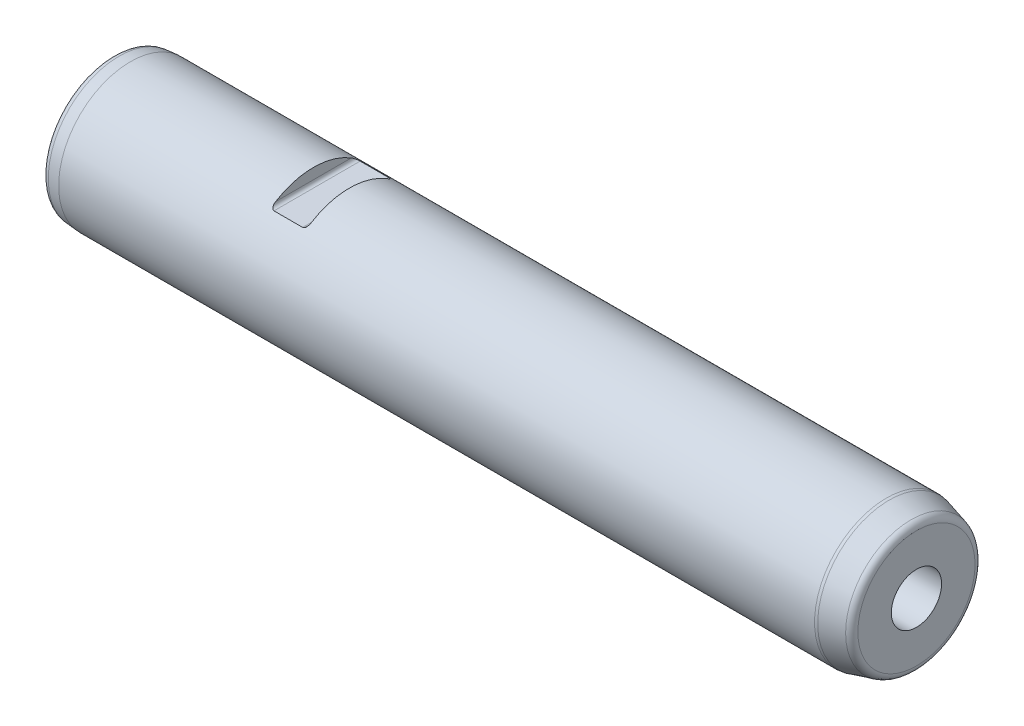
ISO-10303-21;
HEADER;
FILE_DESCRIPTION(('STEP AP214'),'2;1');
FILE_NAME('part.step','',(''),(''),'','','');
FILE_SCHEMA(('AUTOMOTIVE_DESIGN { 1 0 10303 214 1 1 1 1 }'));
ENDSEC;
DATA;
#1=APPLICATION_CONTEXT('core data for automotive mechanical design processes');
#2=APPLICATION_PROTOCOL_DEFINITION('international standard','automotive_design',2000,#1);
#3=PRODUCT_CONTEXT('',#1,'mechanical');
#4=PRODUCT('Part','Part','',(#3));
#5=PRODUCT_RELATED_PRODUCT_CATEGORY('part','',(#4));
#6=PRODUCT_DEFINITION_FORMATION('','',#4);
#7=PRODUCT_DEFINITION_CONTEXT('part definition',#1,'design');
#8=PRODUCT_DEFINITION('design','',#6,#7);
#9=PRODUCT_DEFINITION_SHAPE('','',#8);
#10=(LENGTH_UNIT() NAMED_UNIT(*) SI_UNIT(.MILLI.,.METRE.));
#11=(NAMED_UNIT(*) PLANE_ANGLE_UNIT() SI_UNIT($,.RADIAN.));
#12=(NAMED_UNIT(*) SI_UNIT($,.STERADIAN.) SOLID_ANGLE_UNIT());
#13=UNCERTAINTY_MEASURE_WITH_UNIT(LENGTH_MEASURE(1.E-05),#10,'distance_accuracy_value','');
#14=(GEOMETRIC_REPRESENTATION_CONTEXT(3) GLOBAL_UNCERTAINTY_ASSIGNED_CONTEXT((#13)) GLOBAL_UNIT_ASSIGNED_CONTEXT((#10,
#11,#12)) REPRESENTATION_CONTEXT('',''));
#15=CARTESIAN_POINT('',(0.,0.,0.));
#16=DIRECTION('',(0.,0.,1.));
#17=DIRECTION('',(1.,0.,0.));
#18=AXIS2_PLACEMENT_3D('',#15,#16,#17);
#19=CARTESIAN_POINT('',(0.,0.,0.));
#20=DIRECTION('',(1.,0.,0.));
#21=DIRECTION('',(0.,0.,-1.));
#22=AXIS2_PLACEMENT_3D('',#19,#20,#21);
#23=PLANE('',#22);
#24=CARTESIAN_POINT('',(0.,0.,0.));
#25=DIRECTION('',(1.,0.,0.));
#26=DIRECTION('',(0.,0.,-1.));
#27=AXIS2_PLACEMENT_3D('',#24,#25,#26);
#28=CIRCLE('',#27,17.7298943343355);
#29=CARTESIAN_POINT('',(0.,0.,-17.7298943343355));
#30=VERTEX_POINT('',#29);
#31=EDGE_CURVE('E160',#30,#30,#28,.F.);
#32=ORIENTED_EDGE('',*,*,#31,.T.);
#33=EDGE_LOOP('',(#32));
#34=FACE_BOUND('',#33,.T.);
#35=ADVANCED_FACE('F15',(#34),#23,.F.);
#36=CARTESIAN_POINT('',(0.,0.,0.));
#37=DIRECTION('',(-1.,0.,0.));
#38=DIRECTION('',(0.,0.,1.));
#39=AXIS2_PLACEMENT_3D('',#36,#37,#38);
#40=CYLINDRICAL_SURFACE('',#39,20.);
#41=CARTESIAN_POINT('',(65.,16.,-12.));
#42=CARTESIAN_POINT('',(65.0203975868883,15.9999962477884,-12.0000045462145));
#43=CARTESIAN_POINT('',(65.0407804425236,16.0006247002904,-11.9991670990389));
#44=CARTESIAN_POINT('',(65.0813146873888,16.0031055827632,-11.9958583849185));
#45=CARTESIAN_POINT('',(65.1014663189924,16.004956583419,-11.993389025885));
#46=CARTESIAN_POINT('',(65.1608545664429,16.0122253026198,-11.9836850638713));
#47=CARTESIAN_POINT('',(65.1995323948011,16.0193609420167,-11.9741518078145));
#48=CARTESIAN_POINT('',(65.2739645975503,16.037497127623,-11.9498497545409));
#49=CARTESIAN_POINT('',(65.3097307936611,16.0484809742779,-11.9351035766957));
#50=CARTESIAN_POINT('',(65.3781242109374,16.0735266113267,-11.9013522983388));
#51=CARTESIAN_POINT('',(65.41074138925,16.087597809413,-11.8823341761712));
#52=CARTESIAN_POINT('',(65.4887324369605,16.1259889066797,-11.8302152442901));
#53=CARTESIAN_POINT('',(65.5318948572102,16.1518280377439,-11.7949407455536));
#54=CARTESIAN_POINT('',(65.6109129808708,16.2068340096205,-11.7192462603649));
#55=CARTESIAN_POINT('',(65.6467545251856,16.2360071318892,-11.678816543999));
#56=CARTESIAN_POINT('',(65.7058021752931,16.2906763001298,-11.6023981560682));
#57=CARTESIAN_POINT('',(65.7301168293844,16.3158314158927,-11.567005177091));
#58=CARTESIAN_POINT('',(65.774915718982,16.3670212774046,-11.4944592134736));
#59=CARTESIAN_POINT('',(65.7953974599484,16.3930565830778,-11.4573051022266));
#60=CARTESIAN_POINT('',(65.8518244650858,16.4721604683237,-11.343563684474));
#61=CARTESIAN_POINT('',(65.8825725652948,16.526051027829,-11.2649424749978));
#62=CARTESIAN_POINT('',(65.9240070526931,16.615638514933,-11.1321438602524));
#63=CARTESIAN_POINT('',(65.9379569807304,16.6512330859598,-11.0788360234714));
#64=CARTESIAN_POINT('',(65.9614191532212,16.7223722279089,-10.9711632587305));
#65=CARTESIAN_POINT('',(65.9709289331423,16.7579167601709,-10.9167977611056));
#66=CARTESIAN_POINT('',(65.9857688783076,16.8281581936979,-10.808200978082));
#67=CARTESIAN_POINT('',(65.9911623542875,16.862859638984,-10.7539810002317));
#68=CARTESIAN_POINT('',(65.998268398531,16.9317984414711,-10.6451097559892));
#69=CARTESIAN_POINT('',(65.999986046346,16.9660363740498,-10.5904591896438));
#70=CARTESIAN_POINT('',(66.,17.,-10.5356537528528));
#71=B_SPLINE_CURVE_WITH_KNOTS('',3,(#41,#42,#43,#44,#45,#46,#47,#48,#49,#50,#51,#52,#53,#54,#55,
#56,#57,#58,#59,#60,#61,#62,#63,#64,#65,#66,#67,#68,#69,#70),.UNSPECIFIED.,.F.,.F.,(4,2,2,2,2,2,
2,2,2,2,2,2,2,2,4),(0.,0.0611385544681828,0.122205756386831,0.242843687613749,0.362964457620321,
0.483456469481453,0.66674777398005,0.850390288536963,0.999479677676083,1.14866576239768,
1.44807901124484,1.6447520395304,1.84153410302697,2.03522492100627,2.22864790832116),.UNSPECIFIED.);
#72=CARTESIAN_POINT('',(65.,16.,-12.));
#73=VERTEX_POINT('',#72);
#74=CARTESIAN_POINT('',(66.,17.,-10.5356537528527));
#75=VERTEX_POINT('',#74);
#76=EDGE_CURVE('E206',#73,#75,#71,.T.);
#77=ORIENTED_EDGE('',*,*,#76,.T.);
#78=CARTESIAN_POINT('',(66.,0.,0.));
#79=DIRECTION('',(1.,0.,0.));
#80=DIRECTION('',(0.,0.,-1.));
#81=AXIS2_PLACEMENT_3D('',#78,#79,#80);
#82=CIRCLE('',#81,20.);
#83=CARTESIAN_POINT('',(66.,17.,10.5356537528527));
#84=VERTEX_POINT('',#83);
#85=EDGE_CURVE('E9',#75,#84,#82,.T.);
#86=ORIENTED_EDGE('',*,*,#85,.T.);
#87=CARTESIAN_POINT('',(66.,17.,10.5356537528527));
#88=CARTESIAN_POINT('',(65.9999580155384,16.9556282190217,10.6072606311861));
#89=CARTESIAN_POINT('',(65.9970414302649,16.9107662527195,10.6786284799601));
#90=CARTESIAN_POINT('',(65.9847801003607,16.8201915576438,10.8207316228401));
#91=CARTESIAN_POINT('',(65.9754049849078,16.7744758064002,10.8914623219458));
#92=CARTESIAN_POINT('',(65.9494193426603,16.6823378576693,11.0320779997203));
#93=CARTESIAN_POINT('',(65.9327445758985,16.6359130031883,11.1019496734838));
#94=CARTESIAN_POINT('',(65.8911331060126,16.5434346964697,11.2392876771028));
#95=CARTESIAN_POINT('',(65.8662148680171,16.4973806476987,11.3067590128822));
#96=CARTESIAN_POINT('',(65.8154112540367,16.4198497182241,11.4189199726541));
#97=CARTESIAN_POINT('',(65.7919526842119,16.3880587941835,11.4644877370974));
#98=CARTESIAN_POINT('',(65.739534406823,16.3256491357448,11.5531862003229));
#99=CARTESIAN_POINT('',(65.7105793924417,16.2950294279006,11.596318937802));
#100=CARTESIAN_POINT('',(65.6461040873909,16.2354774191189,11.6795510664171));
#101=CARTESIAN_POINT('',(65.610528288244,16.2065623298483,11.7196204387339));
#102=CARTESIAN_POINT('',(65.5321445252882,16.1520057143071,11.7946959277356));
#103=CARTESIAN_POINT('',(65.489347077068,16.1263595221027,11.829709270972));
#104=CARTESIAN_POINT('',(65.4114116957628,16.0878834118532,11.8819483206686));
#105=CARTESIAN_POINT('',(65.3783803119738,16.0736117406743,11.9012377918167));
#106=CARTESIAN_POINT('',(65.3090792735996,16.048251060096,11.9354131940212));
#107=CARTESIAN_POINT('',(65.2728207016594,16.0371516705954,11.9503134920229));
#108=CARTESIAN_POINT('',(65.1981046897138,16.0190813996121,11.9745255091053));
#109=CARTESIAN_POINT('',(65.1596911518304,16.0120479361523,11.9839219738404));
#110=CARTESIAN_POINT('',(65.10072428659,16.0048841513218,11.9934856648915));
#111=CARTESIAN_POINT('',(65.0807179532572,16.0030600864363,11.9959190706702));
#112=CARTESIAN_POINT('',(65.040479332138,16.0006154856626,11.9991793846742));
#113=CARTESIAN_POINT('',(65.0202468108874,15.9999963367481,12.0000044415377));
#114=CARTESIAN_POINT('',(65.,16.,12.));
#115=B_SPLINE_CURVE_WITH_KNOTS('',3,(#87,#88,#89,#90,#91,#92,#93,#94,#95,#96,#97,#98,#99,#100,
#101,#102,#103,#104,#105,#106,#107,#108,#109,#110,#111,#112,#113,#114),.UNSPECIFIED.,.F.,.F.,(4,
2,2,2,2,2,2,2,2,2,2,2,2,4),(0.,0.252754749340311,0.506706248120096,0.762939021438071,
1.01860168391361,1.19928577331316,1.37981627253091,1.56193473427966,1.74379026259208,
1.86586776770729,1.98754112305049,2.10728809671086,2.16790599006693,2.22859361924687),.UNSPECIFIED.);
#116=CARTESIAN_POINT('',(65.,16.,12.));
#117=VERTEX_POINT('',#116);
#118=EDGE_CURVE('E23',#84,#117,#115,.T.);
#119=ORIENTED_EDGE('',*,*,#118,.T.);
#120=DIRECTION('',(-1.,0.,0.));
#121=VECTOR('',#120,1.);
#122=CARTESIAN_POINT('',(0.,16.,12.));
#123=LINE('',#122,#121);
#124=CARTESIAN_POINT('',(57.,16.,12.));
#125=VERTEX_POINT('',#124);
#126=EDGE_CURVE('E74',#117,#125,#123,.T.);
#127=ORIENTED_EDGE('',*,*,#126,.T.);
#128=CARTESIAN_POINT('',(57.,16.,12.));
#129=CARTESIAN_POINT('',(56.9796024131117,15.9999962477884,12.0000045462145));
#130=CARTESIAN_POINT('',(56.9592195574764,16.0006247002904,11.9991670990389));
#131=CARTESIAN_POINT('',(56.9186853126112,16.0031055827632,11.9958583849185));
#132=CARTESIAN_POINT('',(56.8985336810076,16.004956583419,11.993389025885));
#133=CARTESIAN_POINT('',(56.839145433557,16.0122253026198,11.9836850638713));
#134=CARTESIAN_POINT('',(56.8004676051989,16.0193609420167,11.9741518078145));
#135=CARTESIAN_POINT('',(56.7260354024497,16.037497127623,11.9498497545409));
#136=CARTESIAN_POINT('',(56.6902692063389,16.0484809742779,11.9351035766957));
#137=CARTESIAN_POINT('',(56.6218757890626,16.0735266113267,11.9013522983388));
#138=CARTESIAN_POINT('',(56.58925861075,16.087597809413,11.8823341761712));
#139=CARTESIAN_POINT('',(56.5112675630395,16.1259889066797,11.8302152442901));
#140=CARTESIAN_POINT('',(56.4681051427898,16.1518280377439,11.7949407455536));
#141=CARTESIAN_POINT('',(56.3890870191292,16.2068340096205,11.7192462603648));
#142=CARTESIAN_POINT('',(56.3532454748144,16.2360071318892,11.678816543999));
#143=CARTESIAN_POINT('',(56.2941978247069,16.2906763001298,11.6023981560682));
#144=CARTESIAN_POINT('',(56.2698831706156,16.3158314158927,11.567005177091));
#145=CARTESIAN_POINT('',(56.225084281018,16.3670212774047,11.4944592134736));
#146=CARTESIAN_POINT('',(56.2046025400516,16.3930565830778,11.4573051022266));
#147=CARTESIAN_POINT('',(56.1481755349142,16.4721604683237,11.343563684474));
#148=CARTESIAN_POINT('',(56.1174274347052,16.5260510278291,11.2649424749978));
#149=CARTESIAN_POINT('',(56.0759929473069,16.6156385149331,11.1321438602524));
#150=CARTESIAN_POINT('',(56.0620430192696,16.6512330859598,11.0788360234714));
#151=CARTESIAN_POINT('',(56.0385808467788,16.7223722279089,10.9711632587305));
#152=CARTESIAN_POINT('',(56.0290710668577,16.7579167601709,10.9167977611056));
#153=CARTESIAN_POINT('',(56.0142311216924,16.8281581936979,10.808200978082));
#154=CARTESIAN_POINT('',(56.0088376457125,16.862859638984,10.7539810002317));
#155=CARTESIAN_POINT('',(56.001731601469,16.9317984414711,10.6451097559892));
#156=CARTESIAN_POINT('',(56.000013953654,16.9660363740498,10.5904591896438));
#157=CARTESIAN_POINT('',(56.,17.,10.5356537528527));
#158=B_SPLINE_CURVE_WITH_KNOTS('',3,(#128,#129,#130,#131,#132,#133,#134,#135,#136,#137,#138,
#139,#140,#141,#142,#143,#144,#145,#146,#147,#148,#149,#150,#151,#152,#153,#154,#155,#156,#157),
.UNSPECIFIED.,.F.,.F.,(4,2,2,2,2,2,2,2,2,2,2,2,2,2,4),(0.,0.061138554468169,0.122205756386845,
0.242843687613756,0.362964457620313,0.483456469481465,0.666747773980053,0.850390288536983,
0.999479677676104,1.14866576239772,1.4480790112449,1.64475203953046,1.841534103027,
2.03522492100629,2.22864790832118),.UNSPECIFIED.);
#159=CARTESIAN_POINT('',(56.,17.,10.5356537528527));
#160=VERTEX_POINT('',#159);
#161=EDGE_CURVE('E65',#125,#160,#158,.T.);
#162=ORIENTED_EDGE('',*,*,#161,.T.);
#163=CARTESIAN_POINT('',(56.,0.,0.));
#164=DIRECTION('',(-1.,0.,0.));
#165=DIRECTION('',(0.,0.,1.));
#166=AXIS2_PLACEMENT_3D('',#163,#164,#165);
#167=CIRCLE('',#166,20.);
#168=CARTESIAN_POINT('',(56.,17.,-10.5356537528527));
#169=VERTEX_POINT('',#168);
#170=EDGE_CURVE('E54',#160,#169,#167,.T.);
#171=ORIENTED_EDGE('',*,*,#170,.T.);
#172=CARTESIAN_POINT('',(56.,17.,-10.5356537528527));
#173=CARTESIAN_POINT('',(56.0000419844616,16.9556282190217,-10.6072606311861));
#174=CARTESIAN_POINT('',(56.0029585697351,16.9107662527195,-10.6786284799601));
#175=CARTESIAN_POINT('',(56.0152198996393,16.8201915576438,-10.8207316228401));
#176=CARTESIAN_POINT('',(56.0245950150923,16.7744758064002,-10.8914623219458));
#177=CARTESIAN_POINT('',(56.0505806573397,16.6823378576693,-11.0320779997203));
#178=CARTESIAN_POINT('',(56.0672554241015,16.6359130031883,-11.1019496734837));
#179=CARTESIAN_POINT('',(56.1088668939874,16.5434346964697,-11.2392876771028));
#180=CARTESIAN_POINT('',(56.1337851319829,16.4973806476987,-11.3067590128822));
#181=CARTESIAN_POINT('',(56.1845887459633,16.4198497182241,-11.4189199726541));
#182=CARTESIAN_POINT('',(56.2080473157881,16.3880587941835,-11.4644877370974));
#183=CARTESIAN_POINT('',(56.260465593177,16.3256491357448,-11.5531862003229));
#184=CARTESIAN_POINT('',(56.2894206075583,16.2950294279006,-11.596318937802));
#185=CARTESIAN_POINT('',(56.3538959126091,16.2354774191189,-11.6795510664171));
#186=CARTESIAN_POINT('',(56.389471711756,16.2065623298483,-11.719620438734));
#187=CARTESIAN_POINT('',(56.4678554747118,16.1520057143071,-11.7946959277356));
#188=CARTESIAN_POINT('',(56.510652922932,16.1263595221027,-11.829709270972));
#189=CARTESIAN_POINT('',(56.5885883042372,16.0878834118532,-11.8819483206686));
#190=CARTESIAN_POINT('',(56.6216196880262,16.0736117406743,-11.9012377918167));
#191=CARTESIAN_POINT('',(56.6909207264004,16.048251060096,-11.9354131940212));
#192=CARTESIAN_POINT('',(56.7271792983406,16.0371516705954,-11.9503134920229));
#193=CARTESIAN_POINT('',(56.8018953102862,16.0190813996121,-11.9745255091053));
#194=CARTESIAN_POINT('',(56.8403088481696,16.0120479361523,-11.9839219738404));
#195=CARTESIAN_POINT('',(56.89927571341,16.0048841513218,-11.9934856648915));
#196=CARTESIAN_POINT('',(56.9192820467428,16.0030600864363,-11.9959190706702));
#197=CARTESIAN_POINT('',(56.959520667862,16.0006154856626,-11.9991793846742));
#198=CARTESIAN_POINT('',(56.9797531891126,15.9999963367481,-12.0000044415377));
#199=CARTESIAN_POINT('',(57.,16.,-12.));
#200=B_SPLINE_CURVE_WITH_KNOTS('',3,(#172,#173,#174,#175,#176,#177,#178,#179,#180,#181,#182,
#183,#184,#185,#186,#187,#188,#189,#190,#191,#192,#193,#194,#195,#196,#197,#198,#199),
.UNSPECIFIED.,.F.,.F.,(4,2,2,2,2,2,2,2,2,2,2,2,2,4),(0.,0.252754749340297,0.50670624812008,
0.76293902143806,1.0186016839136,1.19928577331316,1.37981627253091,1.56193473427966,
1.74379026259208,1.86586776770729,1.98754112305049,2.10728809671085,2.16790599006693,
2.22859361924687),.UNSPECIFIED.);
#201=CARTESIAN_POINT('',(57.,16.,-12.));
#202=VERTEX_POINT('',#201);
#203=EDGE_CURVE('E59',#169,#202,#200,.T.);
#204=ORIENTED_EDGE('',*,*,#203,.T.);
#205=DIRECTION('',(-1.,0.,0.));
#206=VECTOR('',#205,1.);
#207=CARTESIAN_POINT('',(0.,16.,-12.));
#208=LINE('',#207,#206);
#209=EDGE_CURVE('E75',#202,#73,#208,.F.);
#210=ORIENTED_EDGE('',*,*,#209,.T.);
#211=EDGE_LOOP('',(#77,#86,#119,#127,#162,#171,#204,#210));
#212=FACE_BOUND('',#211,.T.);
#213=CARTESIAN_POINT('',(5.00000000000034,0.,0.));
#214=DIRECTION('',(1.,0.,0.));
#215=DIRECTION('',(0.,0.,-1.));
#216=AXIS2_PLACEMENT_3D('',#213,#214,#215);
#217=CIRCLE('',#216,20.);
#218=CARTESIAN_POINT('',(5.00000000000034,0.,-20.));
#219=VERTEX_POINT('',#218);
#220=EDGE_CURVE('E159',#219,#219,#217,.T.);
#221=ORIENTED_EDGE('',*,*,#220,.T.);
#222=EDGE_LOOP('',(#221));
#223=FACE_BOUND('',#222,.T.);
#224=CARTESIAN_POINT('',(215.605042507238,0.,0.));
#225=DIRECTION('',(1.,0.,0.));
#226=DIRECTION('',(0.,0.,-1.));
#227=AXIS2_PLACEMENT_3D('',#224,#225,#226);
#228=CIRCLE('',#227,20.);
#229=CARTESIAN_POINT('',(215.605042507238,0.,-20.));
#230=VERTEX_POINT('',#229);
#231=EDGE_CURVE('E177',#230,#230,#228,.F.);
#232=ORIENTED_EDGE('',*,*,#231,.T.);
#233=EDGE_LOOP('',(#232));
#234=FACE_BOUND('',#233,.T.);
#235=ADVANCED_FACE('F71',(#212,#223,#234),#40,.T.);
#236=CARTESIAN_POINT('',(224.,0.,0.));
#237=DIRECTION('',(-1.,0.,0.));
#238=DIRECTION('',(0.,0.,1.));
#239=AXIS2_PLACEMENT_3D('',#236,#237,#238);
#240=CONICAL_SURFACE('',#239,17.856406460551,0.26179938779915);
#241=CARTESIAN_POINT('',(222.517638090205,0.,0.));
#242=DIRECTION('',(1.,0.,0.));
#243=DIRECTION('',(0.,0.,-1.));
#244=AXIS2_PLACEMENT_3D('',#241,#242,#243);
#245=CIRCLE('',#244,18.2536041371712);
#246=CARTESIAN_POINT('',(222.517638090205,0.,-18.2536041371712));
#247=VERTEX_POINT('',#246);
#248=EDGE_CURVE('E165',#247,#247,#245,.F.);
#249=ORIENTED_EDGE('',*,*,#248,.T.);
#250=EDGE_LOOP('',(#249));
#251=FACE_BOUND('',#250,.T.);
#252=CARTESIAN_POINT('',(216.381499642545,0.,0.));
#253=DIRECTION('',(1.,0.,0.));
#254=DIRECTION('',(0.,0.,-1.));
#255=AXIS2_PLACEMENT_3D('',#252,#253,#254);
#256=CIRCLE('',#255,19.8977774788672);
#257=CARTESIAN_POINT('',(216.381499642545,0.,-19.8977774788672));
#258=VERTEX_POINT('',#257);
#259=EDGE_CURVE('E190',#258,#258,#256,.T.);
#260=ORIENTED_EDGE('',*,*,#259,.T.);
#261=EDGE_LOOP('',(#260));
#262=FACE_BOUND('',#261,.T.);
#263=ADVANCED_FACE('F122',(#251,#262),#240,.T.);
#264=CARTESIAN_POINT('',(224.,17.856406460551,0.));
#265=DIRECTION('',(-1.,0.,0.));
#266=DIRECTION('',(0.,0.,1.));
#267=AXIS2_PLACEMENT_3D('',#264,#265,#266);
#268=PLANE('',#267);
#269=CARTESIAN_POINT('',(224.,0.,0.));
#270=DIRECTION('',(1.,0.,0.));
#271=DIRECTION('',(0.,0.,-1.));
#272=AXIS2_PLACEMENT_3D('',#269,#270,#271);
#273=CIRCLE('',#272,7.);
#274=CARTESIAN_POINT('',(224.,0.,-7.));
#275=VERTEX_POINT('',#274);
#276=EDGE_CURVE('E180',#275,#275,#273,.T.);
#277=ORIENTED_EDGE('',*,*,#276,.F.);
#278=EDGE_LOOP('',(#277));
#279=FACE_BOUND('',#278,.T.);
#280=CARTESIAN_POINT('',(224.,0.,0.));
#281=DIRECTION('',(-1.,0.,0.));
#282=DIRECTION('',(0.,0.,1.));
#283=AXIS2_PLACEMENT_3D('',#280,#281,#282);
#284=CIRCLE('',#283,16.3217524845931);
#285=CARTESIAN_POINT('',(224.,0.,16.3217524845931));
#286=VERTEX_POINT('',#285);
#287=EDGE_CURVE('E161',#286,#286,#284,.F.);
#288=ORIENTED_EDGE('',*,*,#287,.T.);
#289=EDGE_LOOP('',(#288));
#290=FACE_BOUND('',#289,.T.);
#291=ADVANCED_FACE('F119',(#279,#290),#268,.F.);
#292=CARTESIAN_POINT('',(215.605042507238,0.,0.));
#293=DIRECTION('',(1.,0.,0.));
#294=DIRECTION('',(0.,0.,-1.));
#295=AXIS2_PLACEMENT_3D('',#292,#293,#294);
#296=TOROIDAL_SURFACE('',#295,17.,3.);
#297=ORIENTED_EDGE('',*,*,#259,.F.);
#298=EDGE_LOOP('',(#297));
#299=FACE_BOUND('',#298,.T.);
#300=ORIENTED_EDGE('',*,*,#231,.F.);
#301=EDGE_LOOP('',(#300));
#302=FACE_BOUND('',#301,.T.);
#303=ADVANCED_FACE('F121',(#299,#302),#296,.T.);
#304=CARTESIAN_POINT('',(222.,0.,0.));
#305=DIRECTION('',(-1.,0.,0.));
#306=DIRECTION('',(0.,0.,1.));
#307=AXIS2_PLACEMENT_3D('',#304,#305,#306);
#308=TOROIDAL_SURFACE('',#307,16.3217524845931,2.);
#309=ORIENTED_EDGE('',*,*,#287,.F.);
#310=EDGE_LOOP('',(#309));
#311=FACE_BOUND('',#310,.T.);
#312=ORIENTED_EDGE('',*,*,#248,.F.);
#313=EDGE_LOOP('',(#312));
#314=FACE_BOUND('',#313,.T.);
#315=ADVANCED_FACE('F142',(#311,#314),#308,.T.);
#316=CARTESIAN_POINT('',(0.,0.,0.));
#317=DIRECTION('',(1.,0.,0.));
#318=DIRECTION('',(0.,0.,-1.));
#319=AXIS2_PLACEMENT_3D('',#316,#317,#318);
#320=CONICAL_SURFACE('',#319,19.5625566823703,0.0872664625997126);
#321=CARTESIAN_POINT('',(1.82568851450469,0.,0.));
#322=DIRECTION('',(1.,0.,0.));
#323=DIRECTION('',(0.,0.,-1.));
#324=AXIS2_PLACEMENT_3D('',#321,#322,#323);
#325=CIRCLE('',#324,19.722283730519);
#326=CARTESIAN_POINT('',(1.82568851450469,0.,-19.722283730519));
#327=VERTEX_POINT('',#326);
#328=EDGE_CURVE('E60',#327,#327,#325,.T.);
#329=ORIENTED_EDGE('',*,*,#328,.T.);
#330=EDGE_LOOP('',(#329));
#331=FACE_BOUND('',#330,.T.);
#332=ORIENTED_EDGE('',*,*,#220,.F.);
#333=EDGE_LOOP('',(#332));
#334=FACE_BOUND('',#333,.T.);
#335=ADVANCED_FACE('F145',(#331,#334),#320,.T.);
#336=CARTESIAN_POINT('',(2.,0.,0.));
#337=DIRECTION('',(1.,0.,0.));
#338=DIRECTION('',(0.,0.,-1.));
#339=AXIS2_PLACEMENT_3D('',#336,#337,#338);
#340=TOROIDAL_SURFACE('',#339,17.7298943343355,2.);
#341=ORIENTED_EDGE('',*,*,#328,.F.);
#342=EDGE_LOOP('',(#341));
#343=FACE_BOUND('',#342,.T.);
#344=ORIENTED_EDGE('',*,*,#31,.F.);
#345=EDGE_LOOP('',(#344));
#346=FACE_BOUND('',#345,.T.);
#347=ADVANCED_FACE('F17',(#343,#346),#340,.T.);
#348=CARTESIAN_POINT('',(200.,0.,0.));
#349=DIRECTION('',(1.,0.,0.));
#350=DIRECTION('',(0.,0.,-1.));
#351=AXIS2_PLACEMENT_3D('',#348,#349,#350);
#352=PLANE('',#351);
#353=CARTESIAN_POINT('',(200.,0.,0.));
#354=DIRECTION('',(1.,0.,0.));
#355=DIRECTION('',(0.,0.,-1.));
#356=AXIS2_PLACEMENT_3D('',#353,#354,#355);
#357=CIRCLE('',#356,7.);
#358=CARTESIAN_POINT('',(200.,0.,-7.));
#359=VERTEX_POINT('',#358);
#360=EDGE_CURVE('E173',#359,#359,#357,.T.);
#361=ORIENTED_EDGE('',*,*,#360,.T.);
#362=EDGE_LOOP('',(#361));
#363=FACE_BOUND('',#362,.T.);
#364=CARTESIAN_POINT('',(200.,0.,0.));
#365=DIRECTION('',(1.,0.,0.));
#366=DIRECTION('',(0.,0.,-1.));
#367=AXIS2_PLACEMENT_3D('',#364,#365,#366);
#368=CIRCLE('',#367,5.1);
#369=CARTESIAN_POINT('',(200.,0.,-5.1));
#370=VERTEX_POINT('',#369);
#371=EDGE_CURVE('E170',#370,#370,#368,.F.);
#372=ORIENTED_EDGE('',*,*,#371,.T.);
#373=EDGE_LOOP('',(#372));
#374=FACE_BOUND('',#373,.T.);
#375=ADVANCED_FACE('F103',(#363,#374),#352,.T.);
#376=CARTESIAN_POINT('',(200.,0.,0.));
#377=DIRECTION('',(1.,0.,0.));
#378=DIRECTION('',(0.,0.,-1.));
#379=AXIS2_PLACEMENT_3D('',#376,#377,#378);
#380=CYLINDRICAL_SURFACE('',#379,7.);
#381=ORIENTED_EDGE('',*,*,#360,.F.);
#382=EDGE_LOOP('',(#381));
#383=FACE_BOUND('',#382,.T.);
#384=ORIENTED_EDGE('',*,*,#276,.T.);
#385=EDGE_LOOP('',(#384));
#386=FACE_BOUND('',#385,.T.);
#387=ADVANCED_FACE('F106',(#383,#386),#380,.F.);
#388=CARTESIAN_POINT('',(194.,0.,0.));
#389=DIRECTION('',(1.,0.,0.));
#390=DIRECTION('',(0.,0.,-1.));
#391=AXIS2_PLACEMENT_3D('',#388,#389,#390);
#392=CONICAL_SURFACE('',#391,5.1,1.0471975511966);
#393=CARTESIAN_POINT('',(191.055513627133,0.,0.));
#394=VERTEX_POINT('',#393);
#395=VERTEX_LOOP('',#394);
#396=FACE_BOUND('',#395,.T.);
#397=CARTESIAN_POINT('',(194.,0.,0.));
#398=DIRECTION('',(1.,0.,0.));
#399=DIRECTION('',(0.,0.,-1.));
#400=AXIS2_PLACEMENT_3D('',#397,#398,#399);
#401=CIRCLE('',#400,5.1);
#402=CARTESIAN_POINT('',(194.,0.,-5.1));
#403=VERTEX_POINT('',#402);
#404=EDGE_CURVE('E172',#403,#403,#401,.T.);
#405=ORIENTED_EDGE('',*,*,#404,.T.);
#406=EDGE_LOOP('',(#405));
#407=FACE_BOUND('',#406,.T.);
#408=ADVANCED_FACE('F110',(#396,#407),#392,.F.);
#409=CARTESIAN_POINT('',(224.,0.,0.));
#410=DIRECTION('',(1.,0.,0.));
#411=DIRECTION('',(0.,0.,-1.));
#412=AXIS2_PLACEMENT_3D('',#409,#410,#411);
#413=CYLINDRICAL_SURFACE('',#412,5.1);
#414=ORIENTED_EDGE('',*,*,#404,.F.);
#415=EDGE_LOOP('',(#414));
#416=FACE_BOUND('',#415,.T.);
#417=ORIENTED_EDGE('',*,*,#371,.F.);
#418=EDGE_LOOP('',(#417));
#419=FACE_BOUND('',#418,.T.);
#420=ADVANCED_FACE('F112',(#416,#419),#413,.F.);
#421=CARTESIAN_POINT('',(66.,17.,-20.));
#422=DIRECTION('',(1.,0.,0.));
#423=DIRECTION('',(0.,0.,-1.));
#424=AXIS2_PLACEMENT_3D('',#421,#422,#423);
#425=PLANE('',#424);
#426=DIRECTION('',(0.,0.,1.));
#427=VECTOR('',#426,1.);
#428=CARTESIAN_POINT('',(66.,17.,-20.));
#429=LINE('',#428,#427);
#430=EDGE_CURVE('E184',#75,#84,#429,.T.);
#431=ORIENTED_EDGE('',*,*,#430,.T.);
#432=ORIENTED_EDGE('',*,*,#85,.F.);
#433=EDGE_LOOP('',(#431,#432));
#434=FACE_BOUND('',#433,.T.);
#435=ADVANCED_FACE('F115',(#434),#425,.F.);
#436=CARTESIAN_POINT('',(65.,17.,-20.));
#437=DIRECTION('',(0.,0.,1.));
#438=DIRECTION('',(1.,0.,0.));
#439=AXIS2_PLACEMENT_3D('',#436,#437,#438);
#440=CYLINDRICAL_SURFACE('',#439,1.);
#441=ORIENTED_EDGE('',*,*,#430,.F.);
#442=ORIENTED_EDGE('',*,*,#76,.F.);
#443=DIRECTION('',(0.,0.,1.));
#444=VECTOR('',#443,1.);
#445=CARTESIAN_POINT('',(65.,16.,-20.));
#446=LINE('',#445,#444);
#447=EDGE_CURVE('E199',#73,#117,#446,.T.);
#448=ORIENTED_EDGE('',*,*,#447,.T.);
#449=ORIENTED_EDGE('',*,*,#118,.F.);
#450=EDGE_LOOP('',(#441,#442,#448,#449));
#451=FACE_BOUND('',#450,.T.);
#452=ADVANCED_FACE('F217',(#451),#440,.F.);
#453=CARTESIAN_POINT('',(57.,16.,-20.));
#454=DIRECTION('',(0.,-1.,0.));
#455=DIRECTION('',(0.,0.,-1.));
#456=AXIS2_PLACEMENT_3D('',#453,#454,#455);
#457=PLANE('',#456);
#458=ORIENTED_EDGE('',*,*,#447,.F.);
#459=ORIENTED_EDGE('',*,*,#209,.F.);
#460=DIRECTION('',(0.,0.,1.));
#461=VECTOR('',#460,1.);
#462=CARTESIAN_POINT('',(57.,16.,-20.));
#463=LINE('',#462,#461);
#464=EDGE_CURVE('E67',#202,#125,#463,.T.);
#465=ORIENTED_EDGE('',*,*,#464,.T.);
#466=ORIENTED_EDGE('',*,*,#126,.F.);
#467=EDGE_LOOP('',(#458,#459,#465,#466));
#468=FACE_BOUND('',#467,.T.);
#469=ADVANCED_FACE('F98',(#468),#457,.F.);
#470=CARTESIAN_POINT('',(57.,17.,-20.));
#471=DIRECTION('',(0.,0.,1.));
#472=DIRECTION('',(1.,0.,0.));
#473=AXIS2_PLACEMENT_3D('',#470,#471,#472);
#474=CYLINDRICAL_SURFACE('',#473,1.);
#475=ORIENTED_EDGE('',*,*,#464,.F.);
#476=ORIENTED_EDGE('',*,*,#203,.F.);
#477=DIRECTION('',(0.,0.,1.));
#478=VECTOR('',#477,1.);
#479=CARTESIAN_POINT('',(56.,17.,-20.));
#480=LINE('',#479,#478);
#481=EDGE_CURVE('E29',#169,#160,#480,.T.);
#482=ORIENTED_EDGE('',*,*,#481,.T.);
#483=ORIENTED_EDGE('',*,*,#161,.F.);
#484=EDGE_LOOP('',(#475,#476,#482,#483));
#485=FACE_BOUND('',#484,.T.);
#486=ADVANCED_FACE('F64',(#485),#474,.F.);
#487=CARTESIAN_POINT('',(56.,20.,-20.));
#488=DIRECTION('',(-1.,0.,0.));
#489=DIRECTION('',(0.,0.,1.));
#490=AXIS2_PLACEMENT_3D('',#487,#488,#489);
#491=PLANE('',#490);
#492=ORIENTED_EDGE('',*,*,#481,.F.);
#493=ORIENTED_EDGE('',*,*,#170,.F.);
#494=EDGE_LOOP('',(#492,#493));
#495=FACE_BOUND('',#494,.T.);
#496=ADVANCED_FACE('F55',(#495),#491,.F.);
#497=CLOSED_SHELL('',(#35,#235,#263,#291,#303,#315,#335,#347,#375,#387,#408,#420,#435,#452,#469,
#486,#496));
#498=MANIFOLD_SOLID_BREP('B1',#497);
#499=ADVANCED_BREP_SHAPE_REPRESENTATION('',(#18,#498),#14);
#500=SHAPE_DEFINITION_REPRESENTATION(#9,#499);
ENDSEC;
END-ISO-10303-21;
